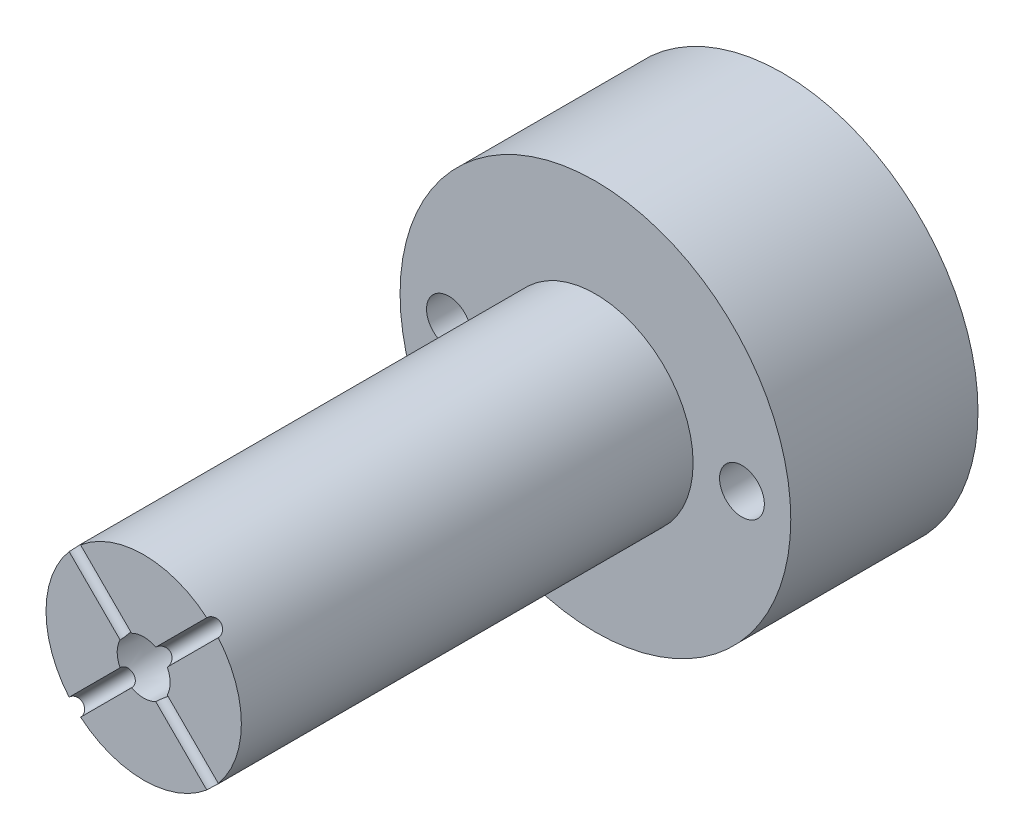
from build123d import *

# Parameters (mm, degrees)
ESQUISSE1_R                  = 24
EXTRUSION1_DEPTH             = 23
ESQUISSE2_R                  = 12
EXTRUSION2_DEPTH             = 55.5
ESQUISSE9_R                  = 2.25
ENL_V_MAT_EXTRU_3_DEPTH      = 86.523388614
CHANFREIN3_SIZE              = 57.66
CHANFREIN3_SIZE2             = 1.006459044
ESQUISSE10_R                 = 5
ENL_V_MAT_EXTRU_4_DEPTH      = 5.5
ESQUISSE11_R                 = 2.75
ENL_V_MAT_EXTRU_5_DEPTH      = 81.50465825
EXTRUSION5_REACH             = 67.056
ESQUISSE13_R                 = 1
EXTRUSION5_DIRECTION_2_REACH = 67.056
R_P_TITION_CIRCULAIRE1_COUNT = 2
R_P_TITION_CIRCULAIRE1_ANGLE = 90


with BuildPart() as part:
    # Esquisse1 → Extrusion1 (new body)
    with BuildSketch(Plane.XY):
        Circle(ESQUISSE1_R)
    extrude(amount=-EXTRUSION1_DEPTH)

    # Esquisse2 → Extrusion2 (add)
    with BuildSketch(Plane.XY):
        Circle(ESQUISSE2_R)
    extrude(amount=EXTRUSION2_DEPTH)

    # Esquisse7 → Enl_vement de mati_re-R_volution15 (revolve, cut)
    with BuildSketch(Plane(origin=(0, 0, 0), x_dir=(1, 0, 0), z_dir=(0, 1, 0))):
        with BuildLine():
            Line((0, 40), (0, 14))
            ThreePointArc((0, 14), (13, 27), (0, 40))
        make_face()
    revolve(axis=Axis((0, 0, -114.445361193), (0, 0, 1)), mode=Mode.SUBTRACT)

    # Esquisse9 → Enl_v. mat.-Extru.3 (cut, through all)
    with BuildSketch(Plane(origin=(0, 0, -23), x_dir=(-1, 0, 0), z_dir=(0, 0, -1))):
        Circle(ESQUISSE9_R)
    extrude(amount=-ENL_V_MAT_EXTRU_3_DEPTH, mode=Mode.SUBTRACT)

    # Chanfrein3
    chanfrein3_edges = [part.edges().sort_by_distance(p)[0] for p in [
        (2.25, 0, 55.5),
    ]]
    chanfrein3_side = [part.faces().sort_by_distance(p)[0] for p in [
        (2.25, 0, 20.651904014),
    ]]
    chamfer(chanfrein3_edges, length=CHANFREIN3_SIZE, length2=CHANFREIN3_SIZE2, reference=chanfrein3_side[0])

    # Esquisse10 → Enl_v. mat.-Extru.4 (cut)
    with BuildSketch(Plane(origin=(0, 0, -23), x_dir=(-1, 0, 0), z_dir=(0, 0, -1))):
        with Locations((-18, 0)):
            Circle(ESQUISSE10_R)
        with Locations((18, 0)):
            Circle(ESQUISSE10_R)
    extrude(amount=-ENL_V_MAT_EXTRU_4_DEPTH, mode=Mode.SUBTRACT)

    # Esquisse11 → Enl_v. mat.-Extru.5 (cut, through all)
    with BuildSketch(Plane(origin=(0, 0, -17.5), x_dir=(-1, 0, 0), z_dir=(0, 0, -1))):
        with Locations((-18, 0)):
            Circle(ESQUISSE11_R)
        with Locations((18, 0)):
            Circle(ESQUISSE11_R)
    extrude(amount=-ENL_V_MAT_EXTRU_5_DEPTH, mode=Mode.SUBTRACT)

    # Esquisse13 → Extrusion5 (cut, up to next)
    with BuildSketch(Plane(origin=(0, 0, 0), x_dir=(-0.7071067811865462, 0.7071067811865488, 0), z_dir=(0.7071067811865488, 0.7071067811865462, 0)), mode=Mode.PRIVATE) as extrusion5_sk1:
        with Locations((0, 55.5)):
            Circle(ESQUISSE13_R)
    extrusion5_tool1 = extrude(extrusion5_sk1.sketch, amount=-EXTRUSION5_REACH, mode=Mode.PRIVATE) & part.part
    extrusion5 = extrusion5_tool1.solids().sort_by_distance((0, 0, 55.5))[0]
    add(extrusion5, mode=Mode.SUBTRACT)

    # Esquisse13 → Extrusion5 direction 2 (cut, up to next)
    with BuildSketch(Plane(origin=(0, 0, 0), x_dir=(-0.7071067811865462, 0.7071067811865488, 0), z_dir=(0.7071067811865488, 0.7071067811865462, 0)), mode=Mode.PRIVATE) as extrusion5_direction_2_sk1:
        with Locations((0, 55.5)):
            Circle(ESQUISSE13_R)
    extrusion5_direction_2_tool1 = extrude(extrusion5_direction_2_sk1.sketch, amount=EXTRUSION5_DIRECTION_2_REACH, mode=Mode.PRIVATE) & part.part
    extrusion5_direction_2 = extrusion5_direction_2_tool1.solids().sort_by_distance((0, 0, 55.5))[0]
    add(extrusion5_direction_2, mode=Mode.SUBTRACT)

    # R_p_tition circulaire1: Extrusion5, Extrusion5 direction 2 ×2 about axis
    r_p_tition_circulaire1_axis = Axis((0, 0, 55.5), (0, 0, -1))
    add([extrusion5.rotate(r_p_tition_circulaire1_axis, i * R_P_TITION_CIRCULAIRE1_ANGLE / (R_P_TITION_CIRCULAIRE1_COUNT - 1)) for i in range(1, R_P_TITION_CIRCULAIRE1_COUNT)], mode=Mode.SUBTRACT)
    add([extrusion5_direction_2.rotate(r_p_tition_circulaire1_axis, i * R_P_TITION_CIRCULAIRE1_ANGLE / (R_P_TITION_CIRCULAIRE1_COUNT - 1)) for i in range(1, R_P_TITION_CIRCULAIRE1_COUNT)], mode=Mode.SUBTRACT)


solid = part.part
